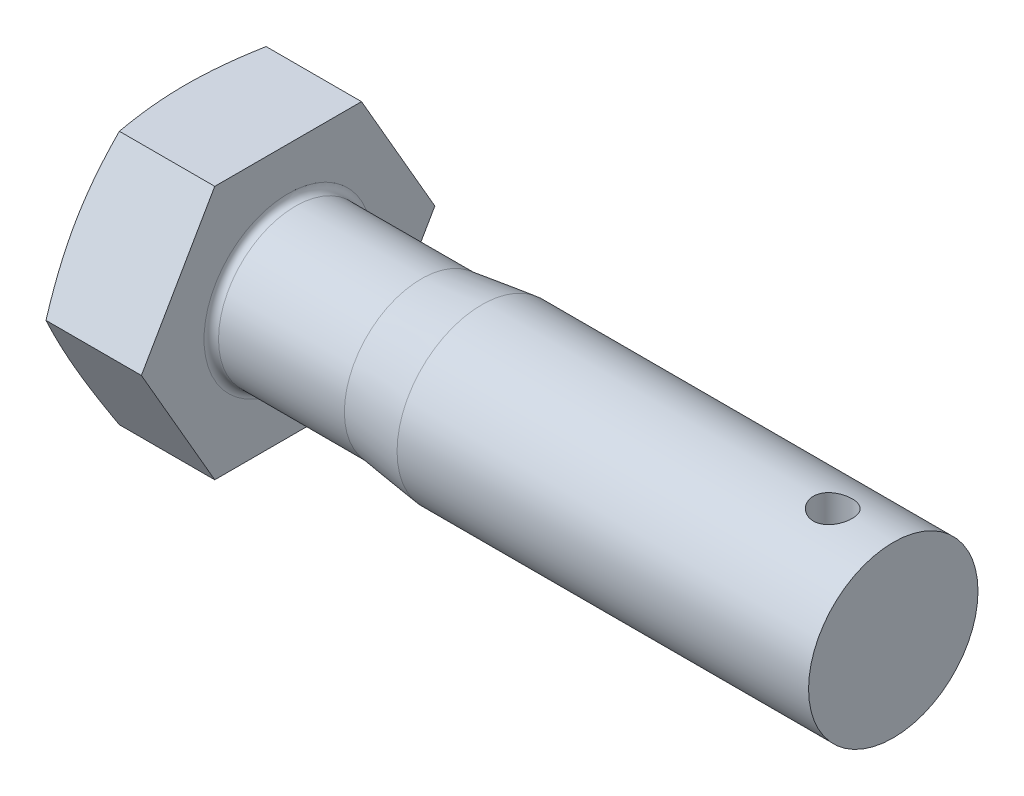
from build123d import *

# Parameters (mm, degrees)
BASEHEAD_DEPTH     = 8.8
SKETCH2_R          = 7
BASEBODY_DEPTH     = 50
SKETCH4_R          = 7.85
CUT_EXTRUDE1_DEPTH = 1.76
HEADFILLET_R       = 0.6
HOLE_DEPTH         = 61.948256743
HOLE_DEPTH_BACK    = 61.948256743
SKETCH6_R          = 1.6


with BuildPart() as part:
    # Sketch1 → BaseHead (new body)
    with BuildSketch(Plane(origin=(0, 0, 0), x_dir=(0, 0, -1), z_dir=(1, 0, 0))):
        Polygon((6.062177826, -10.5), (12.124355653, 0), (6.062177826, 10.5), (-6.062177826, 10.5), (-12.124355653, 0), (-6.062177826, -10.5), align=None)
    extrude(amount=BASEHEAD_DEPTH)

    # Sketch2 → BaseBody (add)
    with BuildSketch(Plane(origin=(8.8, 0, 0), x_dir=(0, 0, -1), z_dir=(1, 0, 0))):
        Circle(SKETCH2_R)
    extrude(amount=BASEBODY_DEPTH)

    # Sketch3 → HeadChamfer (revolve, cut)
    with BuildSketch(Plane(origin=(3.161211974, 0, 2.612290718), x_dir=(0, 0, -1), z_dir=(0, 1, 0)), mode=Mode.PRIVATE) as headchamfer_sk:
        Polygon((14.736646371, 3.161211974), (14.736646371, 2.242421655), (12.212290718, 3.161211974), align=None)
    revolve(headchamfer_sk.sketch.rotate(Axis((1.089857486, 0, 0), (1, 0, 0)), 180), axis=Axis((1.089857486, 0, 0), (1, 0, 0)), mode=Mode.SUBTRACT)

    # Sketch4 → Cut-Extrude1 (cut)
    with BuildSketch(Plane(origin=(0, 0, 0), x_dir=(0, 0, -1), z_dir=(1, 0, 0))):
        Circle(SKETCH4_R)
    extrude(amount=CUT_EXTRUDE1_DEPTH, mode=Mode.SUBTRACT)

    # Sketch5 → Cut-Revolve1 (revolve, cut)
    with BuildSketch(Plane(origin=(-2.92963122, 0, 7.92963122), x_dir=(0, 0, -1), z_dir=(0, 1, 0)), mode=Mode.PRIVATE) as cut_revolve1_sk:
        Polygon((14.92963122, -27.72963122), (14.28013122, -22.72963122), (14.28013122, -11.72963122), (20.63063122, -11.72963122), (20.63063122, -27.72963122), align=None)
    revolve(cut_revolve1_sk.sketch.rotate(Axis((0, 0, 0), (1, 0, 0)), 180), axis=Axis((0, 0, 0), (1, 0, 0)), mode=Mode.SUBTRACT)

    # HeadFillet
    headfillet_edges = [part.edges().sort_by_distance(p)[0] for p in [
        (8.8, 0, -6.3505),
    ]]
    fillet(headfillet_edges, radius=HEADFILLET_R)

    # Sketch6 → Hole (cut, two sides: drawn at the far end of the back side and taken through both)
    with BuildSketch(Plane(origin=(0, 0, 0), x_dir=(1, 0, 0), z_dir=(0, 1, 0)).offset(-HOLE_DEPTH_BACK)):
        with Locations(Location((53.8, 0, 0), (0, 0, 270))):
            Circle(SKETCH6_R)
    extrude(amount=HOLE_DEPTH + HOLE_DEPTH_BACK, mode=Mode.SUBTRACT)


solid = part.part
